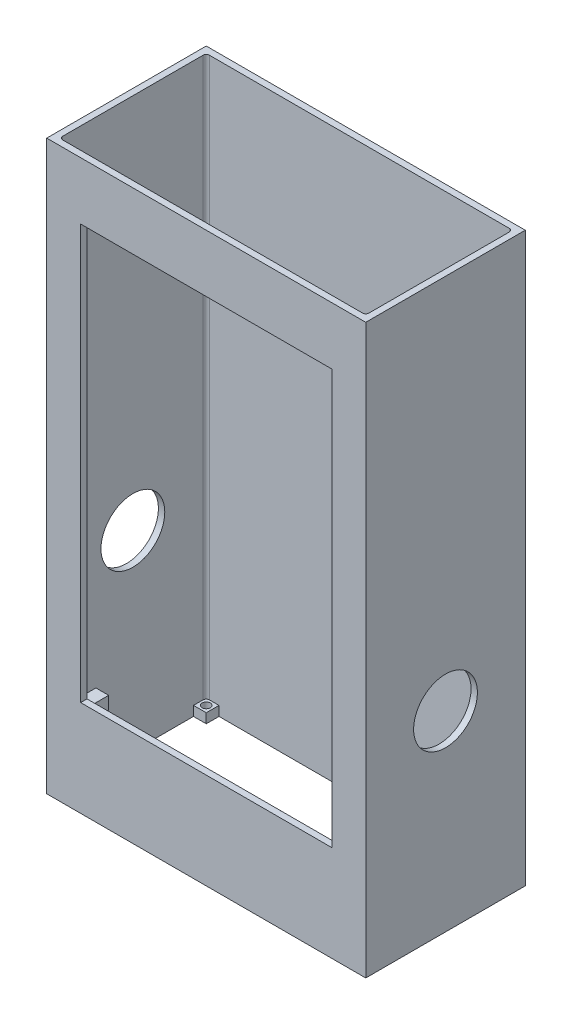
from build123d import *

# Parameters (mm, degrees)
SKETCH1_W               = 127
SKETCH1_H               = 63.5
BOSS_EXTRUDE1_DEPTH     = 302.26
SKETCH2_W               = 121.92
SKETCH2_H               = 58.42
CUT_EXTRUDE1_DEPTH      = 299.72
FILLET3_R               = 1.27
FILLET4_R               = 1.27
FILLET5_R               = 1.27
FILLET6_R               = 1.27
SKETCH3_R               = 12.7
CUT_EXTRUDE3_DEPTH      = 254
SKETCH4_W               = 127
SKETCH4_H               = 63.5
CUT_EXTRUDE4_DEPTH      = 2.54
CUT_EXTRUDE5_DEPTH      = 8.128
CUT_EXTRUDE5_DEPTH_BACK = 25.4
SKETCH5_W               = 100.000000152
SKETCH5_H               = 164.999999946
SKETCH6_R               = 1.600000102
BOSS_EXTRUDE3_DEPTH     = 8.000000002
BOSS_EXTRUDE4_DEPTH     = 7.99999924
BOSS_EXTRUDE5_DEPTH     = 7.99999924
BOSS_EXTRUDE6_DEPTH     = 7.99999924
SKETCH12_W              = 63.5
SKETCH12_H              = 73.66
CUT_EXTRUDE6_DEPTH      = 254
BOSS_EXTRUDE7_START     = -3.81
SKETCH13_R              = 1.651
BOSS_EXTRUDE7_DEPTH     = 3.81


with BuildPart() as part:
    # Sketch1 → Boss-Extrude1 (new body)
    with BuildSketch(Plane(origin=(0, 0, 0), x_dir=(1, 0, 0), z_dir=(0, 1, 0))):
        with Locations((63.5, 31.75)):
            Rectangle(SKETCH1_W, SKETCH1_H)
    extrude(amount=-BOSS_EXTRUDE1_DEPTH)

    # Sketch2 → Cut-Extrude1 (cut)
    with BuildSketch(Plane.XZ.offset(302.26)):
        with Locations((63.5, -31.75)):
            Rectangle(SKETCH2_W, SKETCH2_H)
    extrude(amount=-CUT_EXTRUDE1_DEPTH, mode=Mode.SUBTRACT)

    # Fillet3
    fillet3_edges = [part.edges().sort_by_distance(p)[0] for p in [
        (2.54, -152.4, -60.96),
    ]]
    fillet(fillet3_edges, radius=FILLET3_R)

    # Fillet4
    fillet4_edges = [part.edges().sort_by_distance(p)[0] for p in [
        (2.54, -152.4, -2.54),
    ]]
    fillet(fillet4_edges, radius=FILLET4_R)

    # Fillet5
    fillet5_edges = [part.edges().sort_by_distance(p)[0] for p in [
        (124.46, -152.4, -2.54),
    ]]
    fillet(fillet5_edges, radius=FILLET5_R)

    # Fillet6
    fillet6_edges = [part.edges().sort_by_distance(p)[0] for p in [
        (124.46, -152.4, -60.96),
    ]]
    fillet(fillet6_edges, radius=FILLET6_R)

    # Sketch3 → Cut-Extrude3 (cut)
    with BuildSketch(Plane.ZY):
        with Locations(Location((-31.75, -152.4, 0), (0, 0, 180))):
            Circle(SKETCH3_R)
    extrude(amount=-CUT_EXTRUDE3_DEPTH, mode=Mode.SUBTRACT)

    # Sketch4 → Cut-Extrude4 (cut)
    with BuildSketch(Plane(origin=(0, 0, 0), x_dir=(1, 0, 0), z_dir=(0, 1, 0))):
        with Locations((63.5, 31.75)):
            Rectangle(SKETCH4_W, SKETCH4_H)
    extrude(amount=-CUT_EXTRUDE4_DEPTH, mode=Mode.SUBTRACT)

    # Sketch5 → Cut-Extrude5 (cut, two sides: drawn at the far end of the back side and taken through both)
    with BuildSketch(Plane.XY.offset(-CUT_EXTRUDE5_DEPTH_BACK)):
        with Locations((63.5, -107.899999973)):
            Rectangle(SKETCH5_W, SKETCH5_H)
    extrude(amount=CUT_EXTRUDE5_DEPTH + CUT_EXTRUDE5_DEPTH_BACK, mode=Mode.SUBTRACT)

    # Sketch6 → Boss-Extrude3 (add)
    with BuildSketch(Plane(origin=(0, 0, -2.54), x_dir=(-1, 0, 0), z_dir=(0, 0, -1))):
        Polygon((-11.57603843, -17.860000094), (-9.03603843, -17.860000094), (-9.03603843, -22.940000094), (-14.11603843, -22.940000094), (-14.11603843, -17.860000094), align=None)
        with Locations((-11.57603843, -20.400000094)):
            Circle(SKETCH6_R, mode=Mode.SUBTRACT)
    extrude(amount=BOSS_EXTRUDE3_DEPTH)

    # Sketch8 → Boss-Extrude4 (add)
    with BuildSketch(Plane(origin=(0, 0, -2.54), x_dir=(-1, 0, 0), z_dir=(0, 0, -1))):
        with BuildLine():
            Line((-116.55537096, -19.268629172), (-117.964000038, -17.860000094))
            Line((-117.964000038, -17.860000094), (-117.964000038, -22.940000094))
            Line((-117.964000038, -22.940000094), (-116.55537096, -21.531371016))
            ThreePointArc((-116.55537096, -21.531371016), (-117.02400014, -20.400000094), (-116.55537096, -19.268629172))
        make_face()
        with BuildLine():
            Line((-114.292629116, -19.268629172), (-112.884000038, -17.860000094))
            Line((-112.884000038, -17.860000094), (-117.964000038, -17.860000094))
            Line((-117.964000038, -17.860000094), (-116.55537096, -19.268629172))
            ThreePointArc((-116.55537096, -19.268629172), (-115.424000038, -18.799999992), (-114.292629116, -19.268629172))
        make_face()
        with BuildLine():
            Line((-112.884000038, -22.940000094), (-112.884000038, -17.860000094))
            Line((-112.884000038, -17.860000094), (-114.292629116, -19.268629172))
            ThreePointArc((-114.292629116, -19.268629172), (-113.945792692, -19.787706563), (-113.823999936, -20.400000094))
            ThreePointArc((-113.823999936, -20.400000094), (-113.945792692, -21.012293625), (-114.292629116, -21.531371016))
            Line((-114.292629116, -21.531371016), (-112.884000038, -22.940000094))
        make_face()
        with BuildLine():
            Line((-117.964000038, -22.940000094), (-112.884000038, -22.940000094))
            Line((-112.884000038, -22.940000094), (-114.292629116, -21.531371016))
            ThreePointArc((-114.292629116, -21.531371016), (-115.424000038, -22.000000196), (-116.55537096, -21.531371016))
            Line((-116.55537096, -21.531371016), (-117.964000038, -22.940000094))
        make_face()
    extrude(amount=BOSS_EXTRUDE4_DEPTH)

    # Sketch10 → Boss-Extrude5 (add)
    with BuildSketch(Plane(origin=(0, 0, -2.54), x_dir=(-1, 0, 0), z_dir=(0, 0, -1))):
        with BuildLine():
            Line((-116.55537096, -194.26862893), (-117.964000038, -192.859999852))
            Line((-117.964000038, -192.859999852), (-117.964000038, -197.939999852))
            Line((-117.964000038, -197.939999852), (-116.55537096, -196.531370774))
            ThreePointArc((-116.55537096, -196.531370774), (-117.02400014, -195.399999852), (-116.55537096, -194.26862893))
        make_face()
        with BuildLine():
            Line((-112.884000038, -192.859999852), (-117.964000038, -192.859999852))
            Line((-117.964000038, -192.859999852), (-116.55537096, -194.26862893))
            ThreePointArc((-116.55537096, -194.26862893), (-115.424000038, -193.79999975), (-114.292629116, -194.26862893))
            Line((-114.292629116, -194.26862893), (-112.884000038, -192.859999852))
        make_face()
        with BuildLine():
            Line((-112.884000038, -197.939999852), (-112.884000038, -192.859999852))
            Line((-112.884000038, -192.859999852), (-114.292629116, -194.26862893))
            ThreePointArc((-114.292629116, -194.26862893), (-113.945792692, -194.787706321), (-113.823999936, -195.399999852))
            ThreePointArc((-113.823999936, -195.399999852), (-113.945792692, -196.012293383), (-114.292629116, -196.531370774))
            Line((-114.292629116, -196.531370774), (-112.884000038, -197.939999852))
        make_face()
        with BuildLine():
            Line((-116.55537096, -196.531370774), (-117.964000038, -197.939999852))
            Line((-117.964000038, -197.939999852), (-112.884000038, -197.939999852))
            Line((-112.884000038, -197.939999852), (-114.292629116, -196.531370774))
            ThreePointArc((-114.292629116, -196.531370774), (-115.424000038, -196.999999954), (-116.55537096, -196.531370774))
        make_face()
    extrude(amount=BOSS_EXTRUDE5_DEPTH)

    # Sketch11 → Boss-Extrude6 (add)
    with BuildSketch(Plane(origin=(0, 0, -2.54), x_dir=(-1, 0, 0), z_dir=(0, 0, -1))):
        with BuildLine():
            Line((-12.707370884, -194.26862893), (-14.115999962, -192.859999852))
            Line((-14.115999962, -192.859999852), (-14.115999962, -197.939999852))
            Line((-14.115999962, -197.939999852), (-12.707370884, -196.531370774))
            ThreePointArc((-12.707370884, -196.531370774), (-13.176000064, -195.399999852), (-12.707370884, -194.26862893))
        make_face()
        with BuildLine():
            Line((-9.035999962, -192.859999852), (-14.115999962, -192.859999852))
            Line((-14.115999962, -192.859999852), (-12.707370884, -194.26862893))
            ThreePointArc((-12.707370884, -194.26862893), (-11.575999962, -193.79999975), (-10.44462904, -194.26862893))
            Line((-10.44462904, -194.26862893), (-9.035999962, -192.859999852))
        make_face()
        with BuildLine():
            Line((-9.035999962, -197.939999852), (-9.035999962, -192.859999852))
            Line((-9.035999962, -192.859999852), (-10.44462904, -194.26862893))
            ThreePointArc((-10.44462904, -194.26862893), (-10.097792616, -194.787706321), (-9.97599986, -195.399999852))
            ThreePointArc((-9.97599986, -195.399999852), (-10.097792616, -196.012293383), (-10.44462904, -196.531370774))
            Line((-10.44462904, -196.531370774), (-9.035999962, -197.939999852))
        make_face()
        with BuildLine():
            Line((-12.707370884, -196.531370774), (-14.115999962, -197.939999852))
            Line((-14.115999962, -197.939999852), (-9.035999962, -197.939999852))
            Line((-9.035999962, -197.939999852), (-10.44462904, -196.531370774))
            ThreePointArc((-10.44462904, -196.531370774), (-11.575999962, -196.999999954), (-12.707370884, -196.531370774))
        make_face()
    extrude(amount=BOSS_EXTRUDE6_DEPTH)

    # Sketch12 → Cut-Extrude6 (cut)
    with BuildSketch(Plane(origin=(127, 0, 0), x_dir=(0, 0, -1), z_dir=(1, 0, 0))):
        with Locations((31.75, -265.43)):
            Rectangle(SKETCH12_W, SKETCH12_H)
    extrude(amount=-CUT_EXTRUDE6_DEPTH, mode=Mode.SUBTRACT)

    # Sketch13 → Boss-Extrude7 (add)
    # profile 1 of 4: a face of its own
    with BuildSketch(Plane.XZ.offset(228.6).offset(BOSS_EXTRUDE7_START)):
        with BuildLine():
            Line((7.62, -2.54), (3.81, -2.54))
            ThreePointArc((3.81, -2.54), (2.911974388, -2.911974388), (2.54, -3.81))
            Line((2.54, -3.81), (2.54, -7.62))
            Line((2.54, -7.62), (7.62, -7.62))
            Line((7.62, -7.62), (7.62, -3.81))
            Line((7.62, -3.81), (7.62, -2.54))
        make_face()
        with Locations(Location((5.08, -5.08, 0), (0, 0, 270))):
            Circle(SKETCH13_R, mode=Mode.SUBTRACT)
    # profile 2 of 4: a face of its own
    with BuildSketch(Plane.XZ.offset(228.6).offset(BOSS_EXTRUDE7_START)):
        with BuildLine():
            Line((7.62, -55.88), (2.54, -55.88))
            Line((2.54, -55.88), (2.54, -59.69))
            ThreePointArc((2.54, -59.69), (2.911974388, -60.588025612), (3.81, -60.96))
            Line((3.81, -60.96), (7.62, -60.96))
            Line((7.62, -60.96), (7.62, -55.88))
        make_face()
        with Locations(Location((5.08, -58.42, 0), (0, 0, 270))):
            Circle(SKETCH13_R, mode=Mode.SUBTRACT)
    # profile 3 of 4: a face of its own
    with BuildSketch(Plane.XZ.offset(228.6).offset(BOSS_EXTRUDE7_START)):
        with BuildLine():
            Line((124.46, -59.69), (124.46, -55.88))
            Line((124.46, -55.88), (119.38, -55.88))
            Line((119.38, -55.88), (119.38, -60.96))
            Line((119.38, -60.96), (123.19, -60.96))
            ThreePointArc((123.19, -60.96), (124.088025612, -60.588025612), (124.46, -59.69))
        make_face()
        with Locations(Location((121.92, -58.42, 0), (0, 0, 270))):
            Circle(SKETCH13_R, mode=Mode.SUBTRACT)
    # profile 4 of 4: a face of its own
    with BuildSketch(Plane.XZ.offset(228.6).offset(BOSS_EXTRUDE7_START)):
        with BuildLine():
            Line((123.19, -2.54), (119.38, -2.54))
            Line((119.38, -2.54), (119.38, -7.62))
            Line((119.38, -7.62), (124.46, -7.62))
            Line((124.46, -7.62), (124.46, -3.81))
            ThreePointArc((124.46, -3.81), (124.088025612, -2.911974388), (123.19, -2.54))
        make_face()
        with Locations(Location((121.92, -5.08, 0), (0, 0, 270))):
            Circle(SKETCH13_R, mode=Mode.SUBTRACT)
    extrude(amount=BOSS_EXTRUDE7_DEPTH)


solid = part.part
